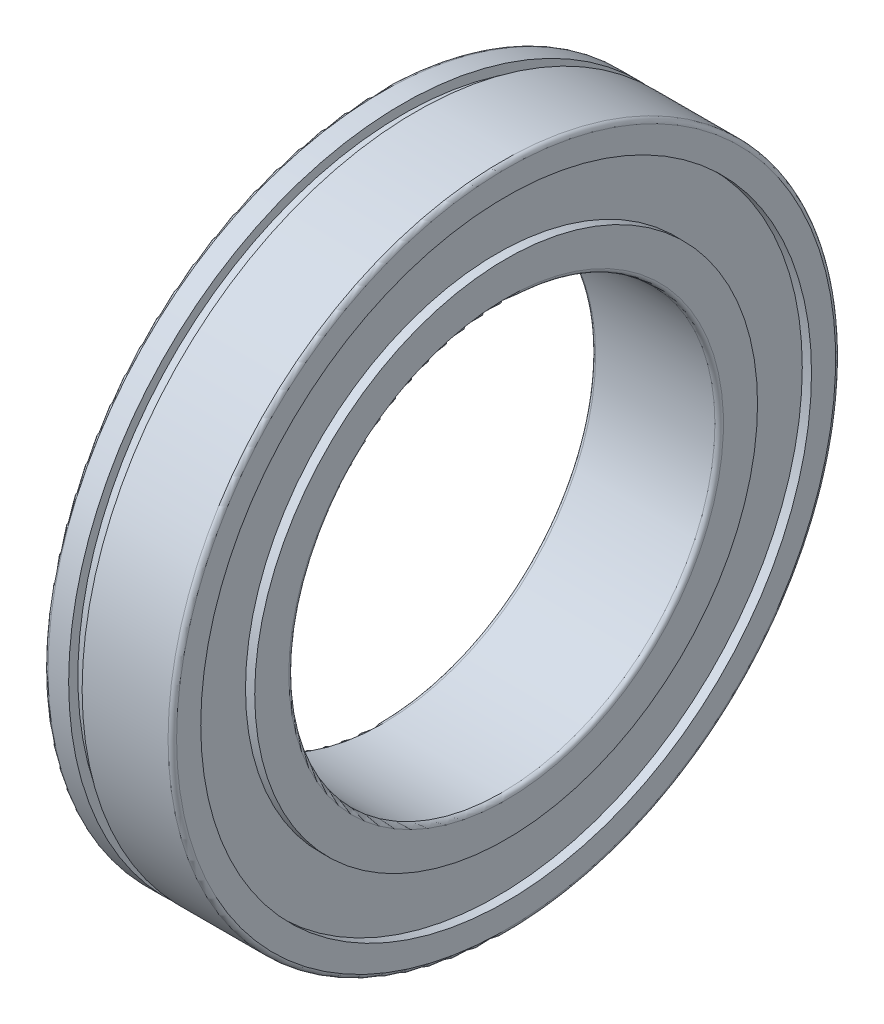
from build123d import *

# Parameters (mm, degrees)
SKETCH2_W = 0.95
SKETCH2_H = 5


with BuildPart() as part:
    # Sketch1 → Revolve1 (revolve)
    with BuildSketch(Plane.XY, mode=Mode.PRIVATE) as revolve1_sk:
        with BuildLine():
            Line((0, 23.25), (0, 21.5))
            Line((0, 21.5), (0.65, 21.5))
            Line((0.65, 21.5), (0.65, 17.7))
            Line((0.65, 17.7), (0, 17.7))
            Line((0, 17.7), (0, 15.3))
            ThreePointArc((0, 15.3), (0.087867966, 15.087867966), (0.3, 15))
            Line((0.3, 15), (8.7, 15))
            ThreePointArc((8.7, 15), (8.912132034, 15.087867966), (9, 15.3))
            Line((9, 15.3), (9, 17.7))
            Line((9, 17.7), (8.35, 17.7))
            Line((8.35, 17.7), (8.35, 21.5))
            Line((8.35, 21.5), (9, 21.5))
            Line((9, 21.5), (9, 23.2))
            ThreePointArc((9, 23.2), (8.912132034, 23.412132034), (8.7, 23.5))
            Line((8.7, 23.5), (0.25, 23.5))
            ThreePointArc((0.25, 23.5), (0.073223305, 23.426776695), (0, 23.25))
        make_face()
    revolve(revolve1_sk.sketch.rotate(Axis((9, 0, 0), (-1, 0, 0)), 270), axis=Axis((9, 0, 0), (-1, 0, 0)))

    # Sketch2 → Cut-Revolve1 (revolve, cut)
    with BuildSketch(Plane.XY, mode=Mode.PRIVATE) as cut_revolve1_sk:
        with Locations((2.175, 25.35)):
            Rectangle(SKETCH2_W, SKETCH2_H)
    revolve(cut_revolve1_sk.sketch.rotate(Axis((2.65, 0, 0), (-1, 0, 0)), 270), axis=Axis((2.65, 0, 0), (-1, 0, 0)), mode=Mode.SUBTRACT)


solid = part.part
